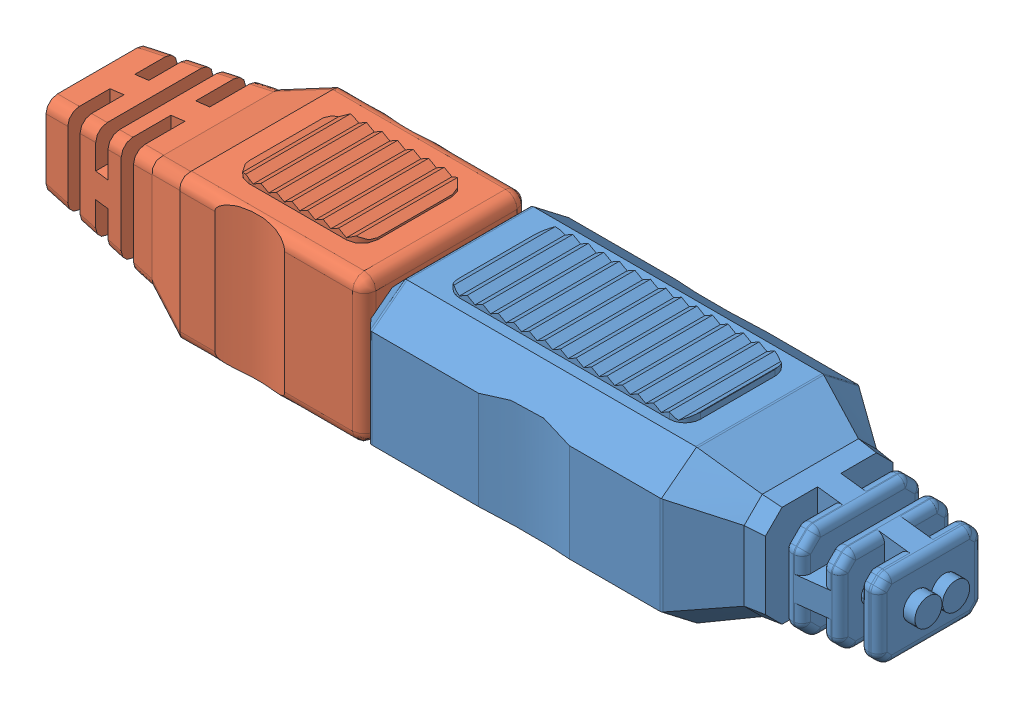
SolidWorks assembly connectors.SLDASM, configuration Default (file format 3100). Lengths in mm.
Overall size (56.44 10.79 12.9).
2 component instances, 2 part files, 3 mates.
Components (placement in the parent):
- minicam female connector-1: minicam female connector.SLDPRT [Default] at (-17.7552 -4.4786 0) size (32.33 10.79 12.9)
- mini cam connector-1: mini cam connector.SLDPRT [Default] at (-19.1014 0.2204 0.1143) x (-1 0 0) z (0 0 1) size (29.24 10.29 10.77)
Mates (geometry in assembly coordinates):
- Coincident5: coincident anti-aligned: plane of minicam female connector-1 through (-11.2274 -14.2751 -2.7686) normal (0 0 -1); plane of mini cam connector-1 through (-13.9706 -6.9297 -2.7686) normal (0 0 1)
- Coincident10: coincident anti-aligned: plane of minicam female connector-1 through (-11.2274 -7.9965 -0.0003) normal (0 1 0); plane of mini cam connector-1 through (-13.9706 -7.9965 -0.8763) normal (0 -1 0)
- Coincident11: coincident anti-aligned: plane of minicam female connector-1 through (-19.1014 -4.4786 -10.6239) normal (-1 0 0); plane of mini cam connector-1 through (-19.1014 0.2204 5.4991) normal (1 0 0)
